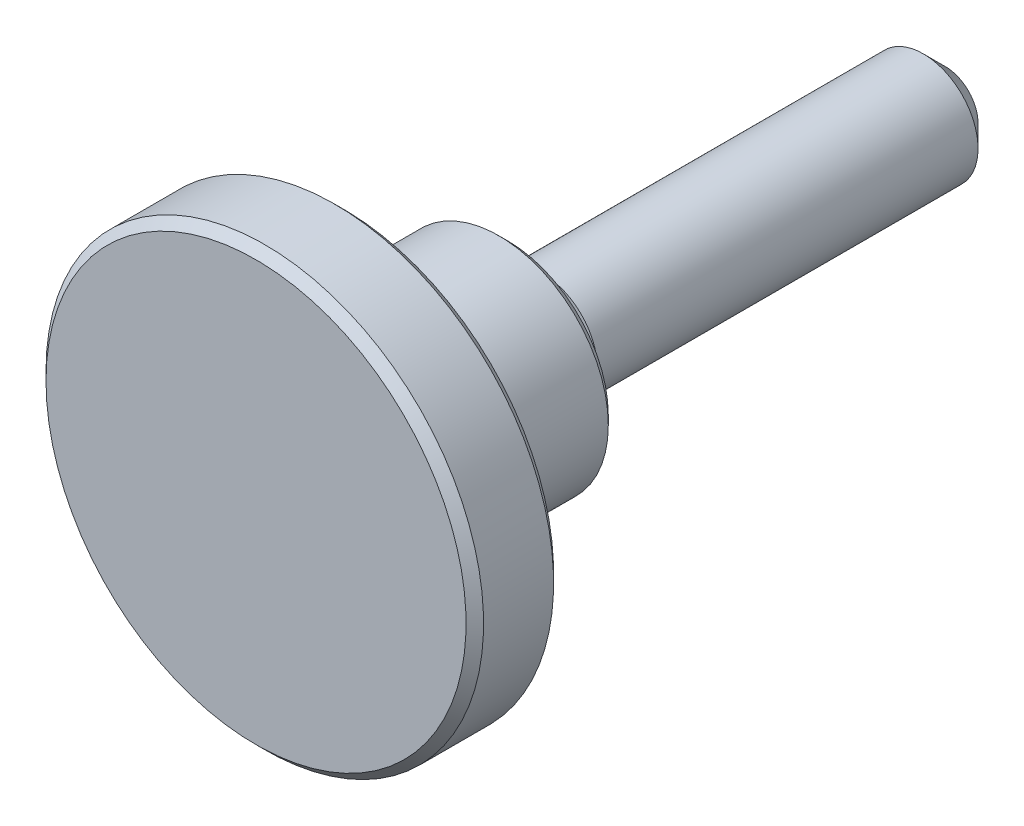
ISO-10303-21;
HEADER;
FILE_DESCRIPTION(('STEP AP214'),'2;1');
FILE_NAME('part.step','',(''),(''),'','','');
FILE_SCHEMA(('AUTOMOTIVE_DESIGN { 1 0 10303 214 1 1 1 1 }'));
ENDSEC;
DATA;
#1=APPLICATION_CONTEXT('core data for automotive mechanical design processes');
#2=APPLICATION_PROTOCOL_DEFINITION('international standard','automotive_design',2000,#1);
#3=PRODUCT_CONTEXT('',#1,'mechanical');
#4=PRODUCT('Part','Part','',(#3));
#5=PRODUCT_RELATED_PRODUCT_CATEGORY('part','',(#4));
#6=PRODUCT_DEFINITION_FORMATION('','',#4);
#7=PRODUCT_DEFINITION_CONTEXT('part definition',#1,'design');
#8=PRODUCT_DEFINITION('design','',#6,#7);
#9=PRODUCT_DEFINITION_SHAPE('','',#8);
#10=(LENGTH_UNIT() NAMED_UNIT(*) SI_UNIT(.MILLI.,.METRE.));
#11=(NAMED_UNIT(*) PLANE_ANGLE_UNIT() SI_UNIT($,.RADIAN.));
#12=(NAMED_UNIT(*) SI_UNIT($,.STERADIAN.) SOLID_ANGLE_UNIT());
#13=UNCERTAINTY_MEASURE_WITH_UNIT(LENGTH_MEASURE(1.E-05),#10,'distance_accuracy_value','');
#14=(GEOMETRIC_REPRESENTATION_CONTEXT(3) GLOBAL_UNCERTAINTY_ASSIGNED_CONTEXT((#13)) GLOBAL_UNIT_ASSIGNED_CONTEXT((#10,
#11,#12)) REPRESENTATION_CONTEXT('',''));
#15=CARTESIAN_POINT('',(0.,0.,0.));
#16=DIRECTION('',(0.,0.,1.));
#17=DIRECTION('',(1.,0.,0.));
#18=AXIS2_PLACEMENT_3D('',#15,#16,#17);
#19=CARTESIAN_POINT('',(0.,1.5,-20.));
#20=DIRECTION('',(0.,0.,-1.));
#21=DIRECTION('',(-1.,0.,0.));
#22=AXIS2_PLACEMENT_3D('',#19,#20,#21);
#23=PLANE('',#22);
#24=CARTESIAN_POINT('',(0.,0.,-20.));
#25=DIRECTION('',(0.,0.,-1.));
#26=DIRECTION('',(-1.,0.,0.));
#27=AXIS2_PLACEMENT_3D('',#24,#25,#26);
#28=CIRCLE('',#27,1.5);
#29=CARTESIAN_POINT('',(-1.5,0.,-20.));
#30=VERTEX_POINT('',#29);
#31=EDGE_CURVE('E8',#30,#30,#28,.T.);
#32=ORIENTED_EDGE('',*,*,#31,.T.);
#33=EDGE_LOOP('',(#32));
#34=FACE_BOUND('',#33,.T.);
#35=ADVANCED_FACE('F12',(#34),#23,.T.);
#36=CARTESIAN_POINT('',(0.,0.,-20.));
#37=DIRECTION('',(0.,0.,1.));
#38=DIRECTION('',(1.,0.,0.));
#39=AXIS2_PLACEMENT_3D('',#36,#37,#38);
#40=CONICAL_SURFACE('',#39,1.5,0.785398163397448);
#41=CARTESIAN_POINT('',(0.,0.,-19.));
#42=DIRECTION('',(0.,0.,-1.));
#43=DIRECTION('',(-1.,0.,0.));
#44=AXIS2_PLACEMENT_3D('',#41,#42,#43);
#45=CIRCLE('',#44,2.5);
#46=CARTESIAN_POINT('',(-2.5,0.,-19.));
#47=VERTEX_POINT('',#46);
#48=EDGE_CURVE('E18',#47,#47,#45,.T.);
#49=ORIENTED_EDGE('',*,*,#48,.T.);
#50=EDGE_LOOP('',(#49));
#51=FACE_BOUND('',#50,.T.);
#52=ORIENTED_EDGE('',*,*,#31,.F.);
#53=EDGE_LOOP('',(#52));
#54=FACE_BOUND('',#53,.T.);
#55=ADVANCED_FACE('F79',(#51,#54),#40,.T.);
#56=CARTESIAN_POINT('',(0.,0.,-22.5));
#57=DIRECTION('',(0.,0.,-1.));
#58=DIRECTION('',(-1.,0.,0.));
#59=AXIS2_PLACEMENT_3D('',#56,#57,#58);
#60=CYLINDRICAL_SURFACE('',#59,2.5);
#61=CARTESIAN_POINT('',(0.,0.,-1.6));
#62=DIRECTION('',(0.,0.,-1.));
#63=DIRECTION('',(-1.,0.,0.));
#64=AXIS2_PLACEMENT_3D('',#61,#62,#63);
#65=CIRCLE('',#64,2.5);
#66=CARTESIAN_POINT('',(-2.5,0.,-1.6));
#67=VERTEX_POINT('',#66);
#68=EDGE_CURVE('E22',#67,#67,#65,.T.);
#69=ORIENTED_EDGE('',*,*,#68,.T.);
#70=EDGE_LOOP('',(#69));
#71=FACE_BOUND('',#70,.T.);
#72=ORIENTED_EDGE('',*,*,#48,.F.);
#73=EDGE_LOOP('',(#72));
#74=FACE_BOUND('',#73,.T.);
#75=ADVANCED_FACE('F84',(#71,#74),#60,.T.);
#76=CARTESIAN_POINT('',(0.,2.25,-1.6));
#77=DIRECTION('',(0.,0.,1.));
#78=DIRECTION('',(1.,0.,0.));
#79=AXIS2_PLACEMENT_3D('',#76,#77,#78);
#80=PLANE('',#79);
#81=CARTESIAN_POINT('',(0.,0.,-1.6));
#82=DIRECTION('',(0.,0.,-1.));
#83=DIRECTION('',(-1.,0.,0.));
#84=AXIS2_PLACEMENT_3D('',#81,#82,#83);
#85=CIRCLE('',#84,2.25);
#86=CARTESIAN_POINT('',(-2.25,0.,-1.6));
#87=VERTEX_POINT('',#86);
#88=EDGE_CURVE('E26',#87,#87,#85,.T.);
#89=ORIENTED_EDGE('',*,*,#88,.T.);
#90=EDGE_LOOP('',(#89));
#91=FACE_BOUND('',#90,.T.);
#92=ORIENTED_EDGE('',*,*,#68,.F.);
#93=EDGE_LOOP('',(#92));
#94=FACE_BOUND('',#93,.T.);
#95=ADVANCED_FACE('F89',(#91,#94),#80,.T.);
#96=CARTESIAN_POINT('',(0.,0.,-1.2));
#97=DIRECTION('',(0.,0.,-1.));
#98=DIRECTION('',(-1.,0.,0.));
#99=AXIS2_PLACEMENT_3D('',#96,#97,#98);
#100=TOROIDAL_SURFACE('',#99,2.25,0.400000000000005);
#101=CARTESIAN_POINT('',(0.,0.,-1.2));
#102=DIRECTION('',(0.,0.,-1.));
#103=DIRECTION('',(-1.,0.,0.));
#104=AXIS2_PLACEMENT_3D('',#101,#102,#103);
#105=CIRCLE('',#104,1.85);
#106=CARTESIAN_POINT('',(-1.85,0.,-1.2));
#107=VERTEX_POINT('',#106);
#108=EDGE_CURVE('E31',#107,#107,#105,.T.);
#109=ORIENTED_EDGE('',*,*,#108,.T.);
#110=EDGE_LOOP('',(#109));
#111=FACE_BOUND('',#110,.T.);
#112=ORIENTED_EDGE('',*,*,#88,.F.);
#113=EDGE_LOOP('',(#112));
#114=FACE_BOUND('',#113,.T.);
#115=ADVANCED_FACE('F96',(#111,#114),#100,.F.);
#116=CARTESIAN_POINT('',(0.,0.,-22.5));
#117=DIRECTION('',(0.,0.,-1.));
#118=DIRECTION('',(-1.,0.,0.));
#119=AXIS2_PLACEMENT_3D('',#116,#117,#118);
#120=CYLINDRICAL_SURFACE('',#119,1.85);
#121=CARTESIAN_POINT('',(0.,0.,-0.400000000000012));
#122=DIRECTION('',(0.,0.,-1.));
#123=DIRECTION('',(-1.,0.,0.));
#124=AXIS2_PLACEMENT_3D('',#121,#122,#123);
#125=CIRCLE('',#124,1.85);
#126=CARTESIAN_POINT('',(-1.85,0.,-0.400000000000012));
#127=VERTEX_POINT('',#126);
#128=EDGE_CURVE('E34',#127,#127,#125,.T.);
#129=ORIENTED_EDGE('',*,*,#128,.T.);
#130=EDGE_LOOP('',(#129));
#131=FACE_BOUND('',#130,.T.);
#132=ORIENTED_EDGE('',*,*,#108,.F.);
#133=EDGE_LOOP('',(#132));
#134=FACE_BOUND('',#133,.T.);
#135=ADVANCED_FACE('F100',(#131,#134),#120,.T.);
#136=CARTESIAN_POINT('',(0.,0.,-0.400000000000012));
#137=DIRECTION('',(0.,0.,-1.));
#138=DIRECTION('',(-1.,0.,0.));
#139=AXIS2_PLACEMENT_3D('',#136,#137,#138);
#140=TOROIDAL_SURFACE('',#139,2.25,0.400000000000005);
#141=CARTESIAN_POINT('',(0.,0.,0.));
#142=DIRECTION('',(0.,0.,-1.));
#143=DIRECTION('',(-1.,0.,0.));
#144=AXIS2_PLACEMENT_3D('',#141,#142,#143);
#145=CIRCLE('',#144,2.25);
#146=CARTESIAN_POINT('',(-2.25,0.,0.));
#147=VERTEX_POINT('',#146);
#148=EDGE_CURVE('E37',#147,#147,#145,.T.);
#149=ORIENTED_EDGE('',*,*,#148,.T.);
#150=EDGE_LOOP('',(#149));
#151=FACE_BOUND('',#150,.T.);
#152=ORIENTED_EDGE('',*,*,#128,.F.);
#153=EDGE_LOOP('',(#152));
#154=FACE_BOUND('',#153,.T.);
#155=ADVANCED_FACE('F104',(#151,#154),#140,.F.);
#156=CARTESIAN_POINT('',(0.,4.6,0.));
#157=DIRECTION('',(0.,0.,-1.));
#158=DIRECTION('',(-1.,0.,0.));
#159=AXIS2_PLACEMENT_3D('',#156,#157,#158);
#160=PLANE('',#159);
#161=CARTESIAN_POINT('',(0.,0.,0.));
#162=DIRECTION('',(0.,0.,-1.));
#163=DIRECTION('',(-1.,0.,0.));
#164=AXIS2_PLACEMENT_3D('',#161,#162,#163);
#165=CIRCLE('',#164,4.6);
#166=CARTESIAN_POINT('',(-4.6,0.,0.));
#167=VERTEX_POINT('',#166);
#168=EDGE_CURVE('E40',#167,#167,#165,.T.);
#169=ORIENTED_EDGE('',*,*,#168,.T.);
#170=EDGE_LOOP('',(#169));
#171=FACE_BOUND('',#170,.T.);
#172=ORIENTED_EDGE('',*,*,#148,.F.);
#173=EDGE_LOOP('',(#172));
#174=FACE_BOUND('',#173,.T.);
#175=ADVANCED_FACE('F108',(#171,#174),#160,.T.);
#176=CARTESIAN_POINT('',(0.,0.,0.));
#177=DIRECTION('',(0.,0.,1.));
#178=DIRECTION('',(1.,0.,0.));
#179=AXIS2_PLACEMENT_3D('',#176,#177,#178);
#180=CONICAL_SURFACE('',#179,4.6,0.785398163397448);
#181=CARTESIAN_POINT('',(0.,0.,0.4));
#182=DIRECTION('',(0.,0.,-1.));
#183=DIRECTION('',(-1.,0.,0.));
#184=AXIS2_PLACEMENT_3D('',#181,#182,#183);
#185=CIRCLE('',#184,5.);
#186=CARTESIAN_POINT('',(-5.,0.,0.4));
#187=VERTEX_POINT('',#186);
#188=EDGE_CURVE('E43',#187,#187,#185,.T.);
#189=ORIENTED_EDGE('',*,*,#188,.T.);
#190=EDGE_LOOP('',(#189));
#191=FACE_BOUND('',#190,.T.);
#192=ORIENTED_EDGE('',*,*,#168,.F.);
#193=EDGE_LOOP('',(#192));
#194=FACE_BOUND('',#193,.T.);
#195=ADVANCED_FACE('F112',(#191,#194),#180,.T.);
#196=CARTESIAN_POINT('',(0.,0.,-22.5));
#197=DIRECTION('',(0.,0.,-1.));
#198=DIRECTION('',(-1.,0.,0.));
#199=AXIS2_PLACEMENT_3D('',#196,#197,#198);
#200=CYLINDRICAL_SURFACE('',#199,5.);
#201=CARTESIAN_POINT('',(0.,0.,6.5));
#202=DIRECTION('',(0.,0.,-1.));
#203=DIRECTION('',(-1.,0.,0.));
#204=AXIS2_PLACEMENT_3D('',#201,#202,#203);
#205=CIRCLE('',#204,5.);
#206=CARTESIAN_POINT('',(-5.,0.,6.5));
#207=VERTEX_POINT('',#206);
#208=EDGE_CURVE('E46',#207,#207,#205,.T.);
#209=ORIENTED_EDGE('',*,*,#208,.T.);
#210=EDGE_LOOP('',(#209));
#211=FACE_BOUND('',#210,.T.);
#212=ORIENTED_EDGE('',*,*,#188,.F.);
#213=EDGE_LOOP('',(#212));
#214=FACE_BOUND('',#213,.T.);
#215=ADVANCED_FACE('F116',(#211,#214),#200,.T.);
#216=CARTESIAN_POINT('',(0.,0.,6.5));
#217=DIRECTION('',(0.,0.,-1.));
#218=DIRECTION('',(-1.,0.,0.));
#219=AXIS2_PLACEMENT_3D('',#216,#217,#218);
#220=TOROIDAL_SURFACE('',#219,6.,1.);
#221=CARTESIAN_POINT('',(0.,0.,7.5));
#222=DIRECTION('',(0.,0.,-1.));
#223=DIRECTION('',(-1.,0.,0.));
#224=AXIS2_PLACEMENT_3D('',#221,#222,#223);
#225=CIRCLE('',#224,6.);
#226=CARTESIAN_POINT('',(-6.,0.,7.5));
#227=VERTEX_POINT('',#226);
#228=EDGE_CURVE('E49',#227,#227,#225,.T.);
#229=ORIENTED_EDGE('',*,*,#228,.T.);
#230=EDGE_LOOP('',(#229));
#231=FACE_BOUND('',#230,.T.);
#232=ORIENTED_EDGE('',*,*,#208,.F.);
#233=EDGE_LOOP('',(#232));
#234=FACE_BOUND('',#233,.T.);
#235=ADVANCED_FACE('F120',(#231,#234),#220,.F.);
#236=CARTESIAN_POINT('',(0.,9.6,7.5));
#237=DIRECTION('',(0.,0.,-1.));
#238=DIRECTION('',(-1.,0.,0.));
#239=AXIS2_PLACEMENT_3D('',#236,#237,#238);
#240=PLANE('',#239);
#241=CARTESIAN_POINT('',(0.,0.,7.5));
#242=DIRECTION('',(0.,0.,-1.));
#243=DIRECTION('',(-1.,0.,0.));
#244=AXIS2_PLACEMENT_3D('',#241,#242,#243);
#245=CIRCLE('',#244,9.6);
#246=CARTESIAN_POINT('',(-9.6,0.,7.5));
#247=VERTEX_POINT('',#246);
#248=EDGE_CURVE('E52',#247,#247,#245,.T.);
#249=ORIENTED_EDGE('',*,*,#248,.T.);
#250=EDGE_LOOP('',(#249));
#251=FACE_BOUND('',#250,.T.);
#252=ORIENTED_EDGE('',*,*,#228,.F.);
#253=EDGE_LOOP('',(#252));
#254=FACE_BOUND('',#253,.T.);
#255=ADVANCED_FACE('F124',(#251,#254),#240,.T.);
#256=CARTESIAN_POINT('',(0.,0.,7.5));
#257=DIRECTION('',(0.,0.,1.));
#258=DIRECTION('',(1.,0.,0.));
#259=AXIS2_PLACEMENT_3D('',#256,#257,#258);
#260=CONICAL_SURFACE('',#259,9.6,0.785398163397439);
#261=CARTESIAN_POINT('',(0.,0.,7.9));
#262=DIRECTION('',(0.,0.,-1.));
#263=DIRECTION('',(-1.,0.,0.));
#264=AXIS2_PLACEMENT_3D('',#261,#262,#263);
#265=CIRCLE('',#264,10.);
#266=CARTESIAN_POINT('',(-10.,0.,7.9));
#267=VERTEX_POINT('',#266);
#268=EDGE_CURVE('E55',#267,#267,#265,.T.);
#269=ORIENTED_EDGE('',*,*,#268,.T.);
#270=EDGE_LOOP('',(#269));
#271=FACE_BOUND('',#270,.T.);
#272=ORIENTED_EDGE('',*,*,#248,.F.);
#273=EDGE_LOOP('',(#272));
#274=FACE_BOUND('',#273,.T.);
#275=ADVANCED_FACE('F128',(#271,#274),#260,.T.);
#276=CARTESIAN_POINT('',(0.,0.,-22.5));
#277=DIRECTION('',(0.,0.,-1.));
#278=DIRECTION('',(-1.,0.,0.));
#279=AXIS2_PLACEMENT_3D('',#276,#277,#278);
#280=CYLINDRICAL_SURFACE('',#279,10.);
#281=CARTESIAN_POINT('',(0.,0.,11.1));
#282=DIRECTION('',(0.,0.,-1.));
#283=DIRECTION('',(-1.,0.,0.));
#284=AXIS2_PLACEMENT_3D('',#281,#282,#283);
#285=CIRCLE('',#284,10.);
#286=CARTESIAN_POINT('',(-10.,0.,11.1));
#287=VERTEX_POINT('',#286);
#288=EDGE_CURVE('E58',#287,#287,#285,.T.);
#289=ORIENTED_EDGE('',*,*,#288,.T.);
#290=EDGE_LOOP('',(#289));
#291=FACE_BOUND('',#290,.T.);
#292=ORIENTED_EDGE('',*,*,#268,.F.);
#293=EDGE_LOOP('',(#292));
#294=FACE_BOUND('',#293,.T.);
#295=ADVANCED_FACE('F76',(#291,#294),#280,.T.);
#296=CARTESIAN_POINT('',(0.,0.,11.1));
#297=DIRECTION('',(0.,0.,-1.));
#298=DIRECTION('',(-1.,0.,0.));
#299=AXIS2_PLACEMENT_3D('',#296,#297,#298);
#300=CONICAL_SURFACE('',#299,10.,0.785398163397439);
#301=CARTESIAN_POINT('',(0.,0.,11.5));
#302=DIRECTION('',(0.,0.,-1.));
#303=DIRECTION('',(-1.,0.,0.));
#304=AXIS2_PLACEMENT_3D('',#301,#302,#303);
#305=CIRCLE('',#304,9.6);
#306=CARTESIAN_POINT('',(-9.6,0.,11.5));
#307=VERTEX_POINT('',#306);
#308=EDGE_CURVE('E61',#307,#307,#305,.T.);
#309=ORIENTED_EDGE('',*,*,#308,.T.);
#310=EDGE_LOOP('',(#309));
#311=FACE_BOUND('',#310,.T.);
#312=ORIENTED_EDGE('',*,*,#288,.F.);
#313=EDGE_LOOP('',(#312));
#314=FACE_BOUND('',#313,.T.);
#315=ADVANCED_FACE('F65',(#311,#314),#300,.T.);
#316=CARTESIAN_POINT('',(0.,9.6,11.5));
#317=DIRECTION('',(0.,0.,1.));
#318=DIRECTION('',(1.,0.,0.));
#319=AXIS2_PLACEMENT_3D('',#316,#317,#318);
#320=PLANE('',#319);
#321=ORIENTED_EDGE('',*,*,#308,.F.);
#322=EDGE_LOOP('',(#321));
#323=FACE_BOUND('',#322,.T.);
#324=ADVANCED_FACE('F68',(#323),#320,.T.);
#325=CLOSED_SHELL('',(#35,#55,#75,#95,#115,#135,#155,#175,#195,#215,#235,#255,#275,#295,#315,#324));
#326=MANIFOLD_SOLID_BREP('B1',#325);
#327=ADVANCED_BREP_SHAPE_REPRESENTATION('',(#18,#326),#14);
#328=SHAPE_DEFINITION_REPRESENTATION(#9,#327);
ENDSEC;
END-ISO-10303-21;
